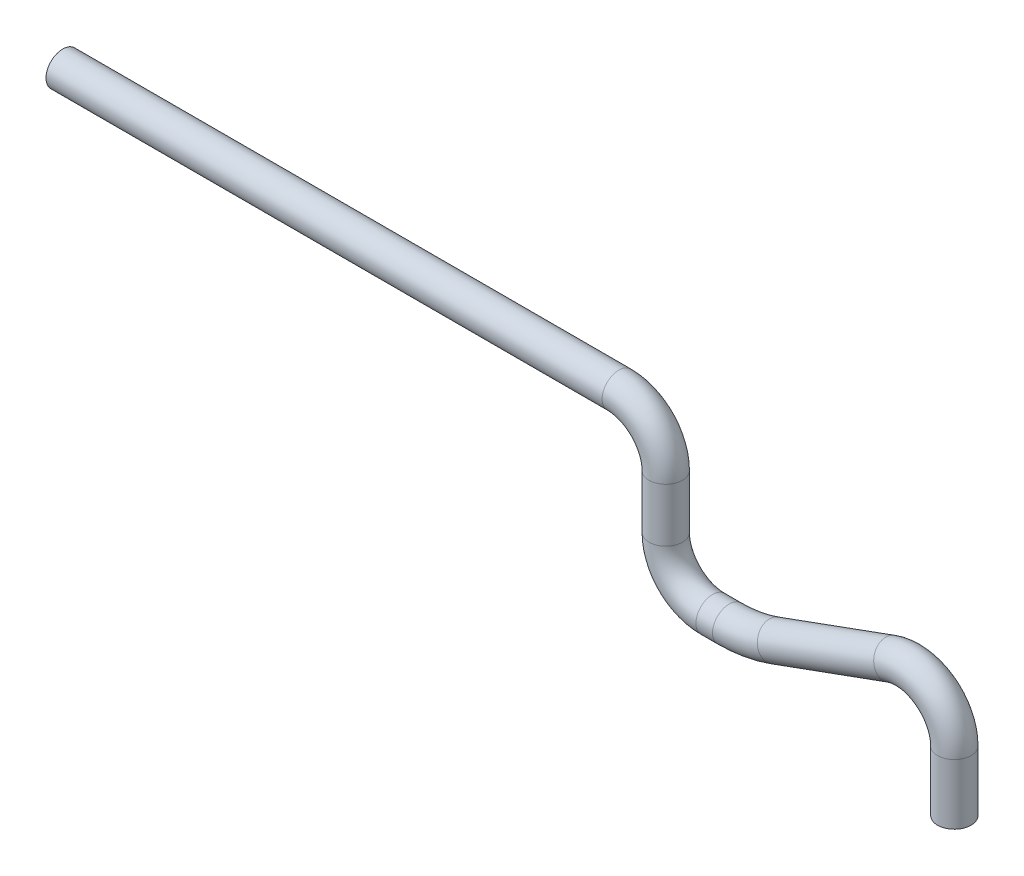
from build123d import *

# Parameters (mm, degrees)
ESQUISSE2_R = 2.5
ESQUISSE5_R = 2.5


with BuildPart() as part:
    # Base-Balayage: sweep along a path in Esquisse1
    with BuildLine(Plane.XY) as base_balayage_path:
        Line((-35, 0), (-7, 0))
        ThreePointArc((-7, 0), (-2.050252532, -2.050252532), (0, -7))
        Line((0, -7), (0, -15))
        ThreePointArc((0, -15), (2.050252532, -19.949747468), (7, -22))
        Line((7, -22), (9.473460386, -22))
        ThreePointArc((9.473460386, -22), (12.946423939, -21.69615506), (16.313863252, -20.793852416))
        Line((16.313863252, -20.793852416), (33.676022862, -14.474543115))
        ThreePointArc((33.676022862, -14.474543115), (40.08519892, -15.318327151), (43.070163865, -21.052391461))
        Line((43.070163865, -21.052391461), (43.070163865, -30.055355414))
    # Esquisse2 → Base-Balayage (sweep)
    with BuildSketch(Plane(origin=(-35, 0, 0), x_dir=(0, 0, -1), z_dir=(1, 0, 0))):
        Circle(ESQUISSE2_R)
    sweep(path=base_balayage_path.line)

    # Boss.-Balayage1: sweep along a path in Esquisse4
    with BuildLine(Plane(origin=(0, 0, 0), x_dir=(1, 0, 0), z_dir=(0, 1, 0))) as boss_balayage1_path:
        Line((-35, 0), (-90, 0))
    # Esquisse5 → Boss.-Balayage1 (sweep)
    with BuildSketch(Plane.ZY.offset(35)):
        Circle(ESQUISSE5_R)
    sweep(path=boss_balayage1_path.line)


solid = part.part
